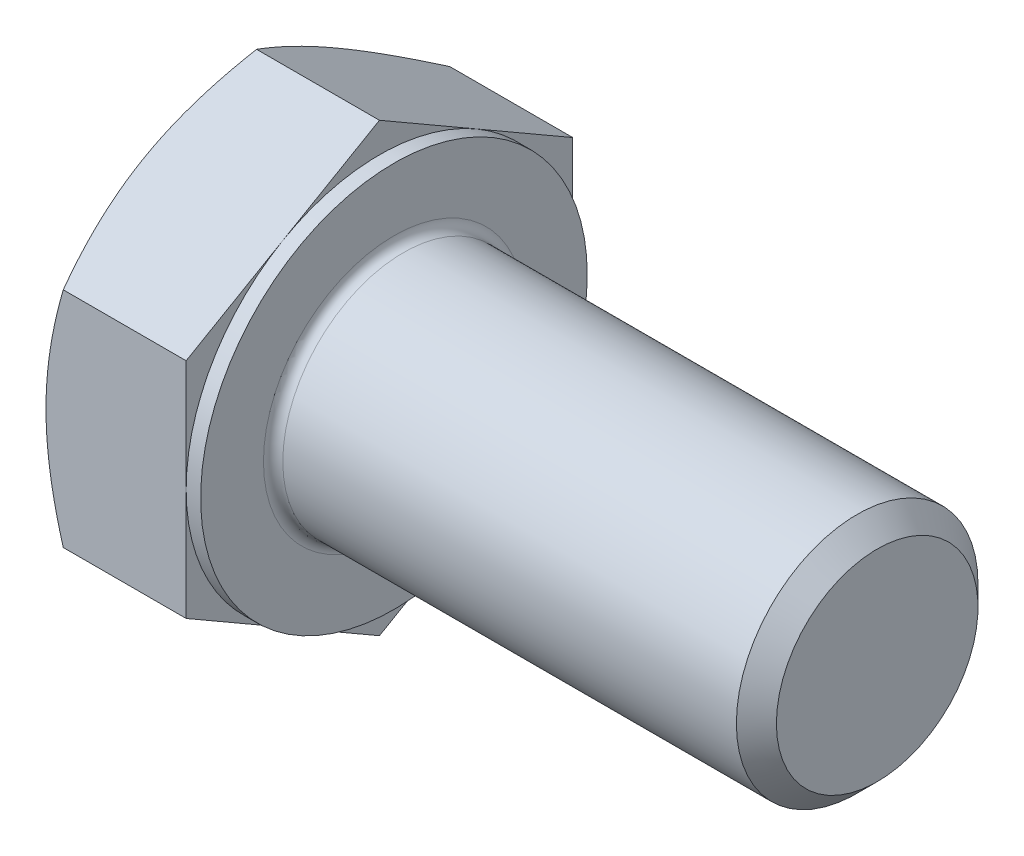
ISO-10303-21;
HEADER;
FILE_DESCRIPTION(('STEP AP214'),'2;1');
FILE_NAME('part.step','',(''),(''),'','','');
FILE_SCHEMA(('AUTOMOTIVE_DESIGN { 1 0 10303 214 1 1 1 1 }'));
ENDSEC;
DATA;
#1=APPLICATION_CONTEXT('core data for automotive mechanical design processes');
#2=APPLICATION_PROTOCOL_DEFINITION('international standard','automotive_design',2000,#1);
#3=PRODUCT_CONTEXT('',#1,'mechanical');
#4=PRODUCT('Part','Part','',(#3));
#5=PRODUCT_RELATED_PRODUCT_CATEGORY('part','',(#4));
#6=PRODUCT_DEFINITION_FORMATION('','',#4);
#7=PRODUCT_DEFINITION_CONTEXT('part definition',#1,'design');
#8=PRODUCT_DEFINITION('design','',#6,#7);
#9=PRODUCT_DEFINITION_SHAPE('','',#8);
#10=(LENGTH_UNIT() NAMED_UNIT(*) SI_UNIT(.MILLI.,.METRE.));
#11=(NAMED_UNIT(*) PLANE_ANGLE_UNIT() SI_UNIT($,.RADIAN.));
#12=(NAMED_UNIT(*) SI_UNIT($,.STERADIAN.) SOLID_ANGLE_UNIT());
#13=UNCERTAINTY_MEASURE_WITH_UNIT(LENGTH_MEASURE(1.E-05),#10,'distance_accuracy_value','');
#14=(GEOMETRIC_REPRESENTATION_CONTEXT(3) GLOBAL_UNCERTAINTY_ASSIGNED_CONTEXT((#13)) GLOBAL_UNIT_ASSIGNED_CONTEXT((#10,
#11,#12)) REPRESENTATION_CONTEXT('',''));
#15=CARTESIAN_POINT('',(0.,0.,0.));
#16=DIRECTION('',(0.,0.,1.));
#17=DIRECTION('',(1.,0.,0.));
#18=AXIS2_PLACEMENT_3D('',#15,#16,#17);
#19=CARTESIAN_POINT('',(6.4,9.23760430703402,0.));
#20=DIRECTION('',(1.,0.,0.));
#21=DIRECTION('',(0.,0.,-1.));
#22=AXIS2_PLACEMENT_3D('',#19,#20,#21);
#23=PLANE('',#22);
#24=CARTESIAN_POINT('',(6.4,0.,0.));
#25=DIRECTION('',(1.,0.,0.));
#26=DIRECTION('',(0.,0.,-1.));
#27=AXIS2_PLACEMENT_3D('',#24,#25,#26);
#28=CIRCLE('',#27,5.4);
#29=CARTESIAN_POINT('',(6.4,0.,-5.4));
#30=VERTEX_POINT('',#29);
#31=EDGE_CURVE('E40',#30,#30,#28,.F.);
#32=ORIENTED_EDGE('',*,*,#31,.T.);
#33=EDGE_LOOP('',(#32));
#34=FACE_BOUND('',#33,.T.);
#35=CARTESIAN_POINT('',(6.4,0.,0.));
#36=DIRECTION('',(1.,0.,0.));
#37=DIRECTION('',(0.,0.,-1.));
#38=AXIS2_PLACEMENT_3D('',#35,#36,#37);
#39=CIRCLE('',#38,8.);
#40=CARTESIAN_POINT('',(6.4,0.,-8.));
#41=VERTEX_POINT('',#40);
#42=EDGE_CURVE('E291',#41,#41,#39,.T.);
#43=ORIENTED_EDGE('',*,*,#42,.T.);
#44=EDGE_LOOP('',(#43));
#45=FACE_BOUND('',#44,.T.);
#46=ADVANCED_FACE('F32',(#34,#45),#23,.T.);
#47=CARTESIAN_POINT('',(0.,0.,0.));
#48=DIRECTION('',(-1.,0.,0.));
#49=DIRECTION('',(0.,0.,1.));
#50=AXIS2_PLACEMENT_3D('',#47,#48,#49);
#51=CYLINDRICAL_SURFACE('',#50,5.);
#52=CARTESIAN_POINT('',(6.8,0.,0.));
#53=DIRECTION('',(1.,0.,0.));
#54=DIRECTION('',(0.,0.,-1.));
#55=AXIS2_PLACEMENT_3D('',#52,#53,#54);
#56=CIRCLE('',#55,5.);
#57=CARTESIAN_POINT('',(6.8,0.,-5.));
#58=VERTEX_POINT('',#57);
#59=EDGE_CURVE('E11',#58,#58,#56,.T.);
#60=ORIENTED_EDGE('',*,*,#59,.T.);
#61=EDGE_LOOP('',(#60));
#62=FACE_BOUND('',#61,.T.);
#63=CARTESIAN_POINT('',(25.5720000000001,0.,0.));
#64=DIRECTION('',(-1.,0.,0.));
#65=DIRECTION('',(0.,0.,1.));
#66=AXIS2_PLACEMENT_3D('',#63,#64,#65);
#67=CIRCLE('',#66,5.);
#68=CARTESIAN_POINT('',(25.5720000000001,0.,5.));
#69=VERTEX_POINT('',#68);
#70=EDGE_CURVE('E270',#69,#69,#67,.T.);
#71=ORIENTED_EDGE('',*,*,#70,.T.);
#72=EDGE_LOOP('',(#71));
#73=FACE_BOUND('',#72,.T.);
#74=ADVANCED_FACE('F244',(#62,#73),#51,.T.);
#75=CARTESIAN_POINT('',(26.4,0.,0.));
#76=DIRECTION('',(-1.,0.,0.));
#77=DIRECTION('',(0.,0.,1.));
#78=AXIS2_PLACEMENT_3D('',#75,#76,#77);
#79=CONICAL_SURFACE('',#78,4.172,0.785398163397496);
#80=ORIENTED_EDGE('',*,*,#70,.F.);
#81=EDGE_LOOP('',(#80));
#82=FACE_BOUND('',#81,.T.);
#83=CARTESIAN_POINT('',(26.4,0.,0.));
#84=DIRECTION('',(-1.,0.,0.));
#85=DIRECTION('',(0.,0.,1.));
#86=AXIS2_PLACEMENT_3D('',#83,#84,#85);
#87=CIRCLE('',#86,4.172);
#88=CARTESIAN_POINT('',(26.4,0.,4.172));
#89=VERTEX_POINT('',#88);
#90=EDGE_CURVE('E268',#89,#89,#87,.T.);
#91=ORIENTED_EDGE('',*,*,#90,.T.);
#92=EDGE_LOOP('',(#91));
#93=FACE_BOUND('',#92,.T.);
#94=ADVANCED_FACE('F249',(#82,#93),#79,.T.);
#95=CARTESIAN_POINT('',(26.4,0.,0.));
#96=DIRECTION('',(-1.,0.,0.));
#97=DIRECTION('',(0.,0.,1.));
#98=AXIS2_PLACEMENT_3D('',#95,#96,#97);
#99=PLANE('',#98);
#100=ORIENTED_EDGE('',*,*,#90,.F.);
#101=EDGE_LOOP('',(#100));
#102=FACE_BOUND('',#101,.T.);
#103=ADVANCED_FACE('F256',(#102),#99,.F.);
#104=CARTESIAN_POINT('',(5.8,8.,0.));
#105=DIRECTION('',(1.,0.,0.));
#106=DIRECTION('',(0.,0.,-1.));
#107=AXIS2_PLACEMENT_3D('',#104,#105,#106);
#108=PLANE('',#107);
#109=DIRECTION('',(0.,0.500000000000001,0.866025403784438));
#110=VECTOR('',#109,1.);
#111=CARTESIAN_POINT('',(5.8,4.618802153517,-8.));
#112=LINE('',#111,#110);
#113=CARTESIAN_POINT('',(5.8,4.618802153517,-8.));
#114=VERTEX_POINT('',#113);
#115=CARTESIAN_POINT('',(5.8,6.92820323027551,-4.00000000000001));
#116=VERTEX_POINT('',#115);
#117=EDGE_CURVE('E164',#114,#116,#112,.T.);
#118=ORIENTED_EDGE('',*,*,#117,.T.);
#119=CARTESIAN_POINT('',(5.8,0.,0.));
#120=DIRECTION('',(-1.,0.,0.));
#121=DIRECTION('',(0.,0.,1.));
#122=AXIS2_PLACEMENT_3D('',#119,#120,#121);
#123=CIRCLE('',#122,8.);
#124=CARTESIAN_POINT('',(5.8,0.,-8.));
#125=VERTEX_POINT('',#124);
#126=EDGE_CURVE('E47',#116,#125,#123,.T.);
#127=ORIENTED_EDGE('',*,*,#126,.T.);
#128=DIRECTION('',(0.,1.,0.));
#129=VECTOR('',#128,1.);
#130=CARTESIAN_POINT('',(5.8,4.618802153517,-8.));
#131=LINE('',#130,#129);
#132=EDGE_CURVE('E294',#125,#114,#131,.T.);
#133=ORIENTED_EDGE('',*,*,#132,.T.);
#134=EDGE_LOOP('',(#118,#127,#133));
#135=FACE_BOUND('',#134,.T.);
#136=ADVANCED_FACE('F259',(#135),#108,.T.);
#137=CARTESIAN_POINT('',(5.8,9.23760430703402,0.));
#138=VERTEX_POINT('',#137);
#139=EDGE_CURVE('E162',#116,#138,#112,.T.);
#140=ORIENTED_EDGE('',*,*,#139,.T.);
#141=DIRECTION('',(0.,-0.500000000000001,0.866025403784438));
#142=VECTOR('',#141,1.);
#143=CARTESIAN_POINT('',(5.8,9.23760430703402,0.));
#144=LINE('',#143,#142);
#145=CARTESIAN_POINT('',(5.8,6.92820323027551,4.00000000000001));
#146=VERTEX_POINT('',#145);
#147=EDGE_CURVE('E161',#138,#146,#144,.T.);
#148=ORIENTED_EDGE('',*,*,#147,.T.);
#149=EDGE_CURVE('E150',#146,#116,#123,.T.);
#150=ORIENTED_EDGE('',*,*,#149,.T.);
#151=EDGE_LOOP('',(#140,#148,#150));
#152=FACE_BOUND('',#151,.T.);
#153=ADVANCED_FACE('F264',(#152),#108,.T.);
#154=CARTESIAN_POINT('',(5.8,4.61880215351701,8.));
#155=VERTEX_POINT('',#154);
#156=EDGE_CURVE('E129',#146,#155,#144,.T.);
#157=ORIENTED_EDGE('',*,*,#156,.T.);
#158=DIRECTION('',(0.,-1.,0.));
#159=VECTOR('',#158,1.);
#160=CARTESIAN_POINT('',(5.8,4.61880215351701,8.));
#161=LINE('',#160,#159);
#162=CARTESIAN_POINT('',(5.8,0.,8.));
#163=VERTEX_POINT('',#162);
#164=EDGE_CURVE('E123',#155,#163,#161,.T.);
#165=ORIENTED_EDGE('',*,*,#164,.T.);
#166=EDGE_CURVE('E127',#163,#146,#123,.T.);
#167=ORIENTED_EDGE('',*,*,#166,.T.);
#168=EDGE_LOOP('',(#157,#165,#167));
#169=FACE_BOUND('',#168,.T.);
#170=ADVANCED_FACE('F125',(#169),#108,.T.);
#171=CARTESIAN_POINT('',(5.8,-4.61880215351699,8.));
#172=VERTEX_POINT('',#171);
#173=EDGE_CURVE('E133',#163,#172,#161,.T.);
#174=ORIENTED_EDGE('',*,*,#173,.T.);
#175=DIRECTION('',(0.,-0.500000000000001,-0.866025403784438));
#176=VECTOR('',#175,1.);
#177=CARTESIAN_POINT('',(5.8,-9.23760430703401,0.));
#178=LINE('',#177,#176);
#179=CARTESIAN_POINT('',(5.8,-6.92820323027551,4.00000000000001));
#180=VERTEX_POINT('',#179);
#181=EDGE_CURVE('E140',#172,#180,#178,.T.);
#182=ORIENTED_EDGE('',*,*,#181,.T.);
#183=EDGE_CURVE('E137',#180,#163,#123,.T.);
#184=ORIENTED_EDGE('',*,*,#183,.T.);
#185=EDGE_LOOP('',(#174,#182,#184));
#186=FACE_BOUND('',#185,.T.);
#187=ADVANCED_FACE('F138',(#186),#108,.T.);
#188=CARTESIAN_POINT('',(5.8,-9.23760430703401,0.));
#189=VERTEX_POINT('',#188);
#190=EDGE_CURVE('E156',#180,#189,#178,.T.);
#191=ORIENTED_EDGE('',*,*,#190,.T.);
#192=DIRECTION('',(0.,0.5,-0.866025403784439));
#193=VECTOR('',#192,1.);
#194=CARTESIAN_POINT('',(5.8,-4.61880215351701,-8.));
#195=LINE('',#194,#193);
#196=CARTESIAN_POINT('',(5.8,-6.92820323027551,-4.));
#197=VERTEX_POINT('',#196);
#198=EDGE_CURVE('E332',#189,#197,#195,.T.);
#199=ORIENTED_EDGE('',*,*,#198,.T.);
#200=EDGE_CURVE('E144',#197,#180,#123,.T.);
#201=ORIENTED_EDGE('',*,*,#200,.T.);
#202=EDGE_LOOP('',(#191,#199,#201));
#203=FACE_BOUND('',#202,.T.);
#204=ADVANCED_FACE('F333',(#203),#108,.T.);
#205=CARTESIAN_POINT('',(5.8,-4.61880215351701,-8.));
#206=VERTEX_POINT('',#205);
#207=EDGE_CURVE('E151',#197,#206,#195,.T.);
#208=ORIENTED_EDGE('',*,*,#207,.T.);
#209=EDGE_CURVE('E295',#206,#125,#131,.T.);
#210=ORIENTED_EDGE('',*,*,#209,.T.);
#211=EDGE_CURVE('E302',#125,#197,#123,.T.);
#212=ORIENTED_EDGE('',*,*,#211,.T.);
#213=EDGE_LOOP('',(#208,#210,#212));
#214=FACE_BOUND('',#213,.T.);
#215=ADVANCED_FACE('F265',(#214),#108,.T.);
#216=CARTESIAN_POINT('',(0.,0.,0.));
#217=DIRECTION('',(-1.,0.,0.));
#218=DIRECTION('',(0.,0.,1.));
#219=AXIS2_PLACEMENT_3D('',#216,#217,#218);
#220=CYLINDRICAL_SURFACE('',#219,8.);
#221=ORIENTED_EDGE('',*,*,#126,.F.);
#222=ORIENTED_EDGE('',*,*,#149,.F.);
#223=ORIENTED_EDGE('',*,*,#166,.F.);
#224=ORIENTED_EDGE('',*,*,#183,.F.);
#225=ORIENTED_EDGE('',*,*,#200,.F.);
#226=ORIENTED_EDGE('',*,*,#211,.F.);
#227=EDGE_LOOP('',(#221,#222,#223,#224,#225,#226));
#228=FACE_BOUND('',#227,.T.);
#229=ORIENTED_EDGE('',*,*,#42,.F.);
#230=EDGE_LOOP('',(#229));
#231=FACE_BOUND('',#230,.T.);
#232=ADVANCED_FACE('F147',(#228,#231),#220,.T.);
#233=CARTESIAN_POINT('',(0.,9.23760430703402,0.));
#234=DIRECTION('',(1.,0.,0.));
#235=DIRECTION('',(0.,0.,-1.));
#236=AXIS2_PLACEMENT_3D('',#233,#234,#235);
#237=PLANE('',#236);
#238=CARTESIAN_POINT('',(0.,0.,0.));
#239=DIRECTION('',(1.,0.,0.));
#240=DIRECTION('',(0.,0.,-1.));
#241=AXIS2_PLACEMENT_3D('',#238,#239,#240);
#242=CIRCLE('',#241,8.);
#243=CARTESIAN_POINT('',(0.,0.,-8.));
#244=VERTEX_POINT('',#243);
#245=CARTESIAN_POINT('',(0.,6.92820323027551,-4.00000000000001));
#246=VERTEX_POINT('',#245);
#247=EDGE_CURVE('E290',#244,#246,#242,.T.);
#248=ORIENTED_EDGE('',*,*,#247,.F.);
#249=CARTESIAN_POINT('',(0.,-6.92820323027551,-4.));
#250=VERTEX_POINT('',#249);
#251=EDGE_CURVE('E286',#250,#244,#242,.T.);
#252=ORIENTED_EDGE('',*,*,#251,.F.);
#253=CARTESIAN_POINT('',(0.,-6.9282032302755,4.00000000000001));
#254=VERTEX_POINT('',#253);
#255=EDGE_CURVE('E289',#254,#250,#242,.T.);
#256=ORIENTED_EDGE('',*,*,#255,.F.);
#257=CARTESIAN_POINT('',(0.,0.,8.));
#258=VERTEX_POINT('',#257);
#259=EDGE_CURVE('E325',#258,#254,#242,.T.);
#260=ORIENTED_EDGE('',*,*,#259,.F.);
#261=CARTESIAN_POINT('',(0.,0.,0.));
#262=DIRECTION('',(-1.,0.,0.));
#263=DIRECTION('',(0.,0.,1.));
#264=AXIS2_PLACEMENT_3D('',#261,#262,#263);
#265=CIRCLE('',#264,8.);
#266=CARTESIAN_POINT('',(0.,6.92820323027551,4.00000000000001));
#267=VERTEX_POINT('',#266);
#268=EDGE_CURVE('E165',#258,#267,#265,.T.);
#269=ORIENTED_EDGE('',*,*,#268,.T.);
#270=EDGE_CURVE('E348',#246,#267,#242,.T.);
#271=ORIENTED_EDGE('',*,*,#270,.F.);
#272=EDGE_LOOP('',(#248,#252,#256,#260,#269,#271));
#273=FACE_BOUND('',#272,.T.);
#274=ADVANCED_FACE('F194',(#273),#237,.F.);
#275=CARTESIAN_POINT('',(0.,0.,0.));
#276=DIRECTION('',(1.,0.,0.));
#277=DIRECTION('',(0.,0.,-1.));
#278=AXIS2_PLACEMENT_3D('',#275,#276,#277);
#279=CONICAL_SURFACE('',#278,8.,1.0471975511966);
#280=CARTESIAN_POINT('',(0.714597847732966,4.61868668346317,8.0002));
#281=CARTESIAN_POINT('',(0.655990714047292,4.72021302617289,7.8243512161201));
#282=CARTESIAN_POINT('',(0.600043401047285,4.82211789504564,7.64784680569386));
#283=CARTESIAN_POINT('',(0.494201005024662,5.02675523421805,7.29340453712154));
#284=CARTESIAN_POINT('',(0.444308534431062,5.12948804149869,7.11546609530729));
#285=CARTESIAN_POINT('',(0.304692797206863,5.43933133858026,6.57880176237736));
#286=CARTESIAN_POINT('',(0.225281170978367,5.64766491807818,6.21795741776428));
#287=CARTESIAN_POINT('',(0.132161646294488,5.95943209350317,5.67796082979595));
#288=CARTESIAN_POINT('',(0.105634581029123,6.06193429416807,5.50042181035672));
#289=CARTESIAN_POINT('',(0.0611531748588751,6.26740224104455,5.1445408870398));
#290=CARTESIAN_POINT('',(0.04319807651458,6.37036794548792,4.96619905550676));
#291=CARTESIAN_POINT('',(0.0163156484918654,6.57647664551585,4.60920831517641));
#292=CARTESIAN_POINT('',(0.00737807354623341,6.67961930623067,4.4305599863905));
#293=CARTESIAN_POINT('',(-0.00127769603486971,6.88599991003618,4.07309829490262));
#294=CARTESIAN_POINT('',(-0.000996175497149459,6.98923785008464,3.89428493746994));
#295=CARTESIAN_POINT('',(0.00814502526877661,7.18224506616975,3.5599866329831));
#296=CARTESIAN_POINT('',(0.0158896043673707,7.27202796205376,3.40447809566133));
#297=CARTESIAN_POINT('',(0.0382011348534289,7.45138347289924,3.09382523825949));
#298=CARTESIAN_POINT('',(0.0527685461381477,7.54095607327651,2.93868094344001));
#299=CARTESIAN_POINT('',(0.106360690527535,7.80932710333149,2.47384868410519));
#300=CARTESIAN_POINT('',(0.155268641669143,7.98765049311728,2.16498351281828));
#301=CARTESIAN_POINT('',(0.277539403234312,8.34618890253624,1.5439767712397));
#302=CARTESIAN_POINT('',(0.351420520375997,8.52635816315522,1.23191445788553));
#303=CARTESIAN_POINT('',(0.519100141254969,8.88400987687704,0.612443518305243));
#304=CARTESIAN_POINT('',(0.612859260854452,9.06149691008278,0.30502695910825));
#305=CARTESIAN_POINT('',(0.714597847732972,9.23771977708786,-0.00019999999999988));
#306=B_SPLINE_CURVE_WITH_KNOTS('',3,(#280,#281,#282,#283,#284,#285,#286,#287,#288,#289,#290,
#291,#292,#293,#294,#295,#296,#297,#298,#299,#300,#301,#302,#303,#304,#305),.UNSPECIFIED.,.F.,
.F.,(4,2,2,2,2,2,2,2,2,2,2,2,4),(0.,0.633973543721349,1.26821965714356,2.53934712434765,
3.15934343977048,3.77928496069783,4.39852133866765,5.01773858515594,5.55680239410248,
6.09590254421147,7.17487077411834,8.27776850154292,9.37850115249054),.UNSPECIFIED.);
#307=CARTESIAN_POINT('',(0.714531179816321,9.23760430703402,0.));
#308=VERTEX_POINT('',#307);
#309=EDGE_CURVE('E213',#267,#308,#306,.T.);
#310=ORIENTED_EDGE('',*,*,#309,.T.);
#311=CARTESIAN_POINT('',(0.714597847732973,9.23771977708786,0.0002));
#312=CARTESIAN_POINT('',(0.655990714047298,9.13619343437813,-0.175648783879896));
#313=CARTESIAN_POINT('',(0.60004340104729,9.03428856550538,-0.352153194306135));
#314=CARTESIAN_POINT('',(0.494201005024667,8.82965122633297,-0.706595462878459));
#315=CARTESIAN_POINT('',(0.444308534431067,8.72691841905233,-0.884533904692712));
#316=CARTESIAN_POINT('',(0.304692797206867,8.41707512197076,-1.42119823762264));
#317=CARTESIAN_POINT('',(0.22528117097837,8.20874154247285,-1.78204258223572));
#318=CARTESIAN_POINT('',(0.13216164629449,7.89697436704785,-2.32203917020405));
#319=CARTESIAN_POINT('',(0.105634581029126,7.79447216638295,-2.49957818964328));
#320=CARTESIAN_POINT('',(0.0611531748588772,7.58900421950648,-2.8554591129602));
#321=CARTESIAN_POINT('',(0.0431980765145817,7.4860385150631,-3.03380094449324));
#322=CARTESIAN_POINT('',(0.0163156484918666,7.27992981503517,-3.39079168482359));
#323=CARTESIAN_POINT('',(0.00737807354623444,7.17678715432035,-3.5694400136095));
#324=CARTESIAN_POINT('',(-0.00127769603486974,6.97040655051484,-3.92690170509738));
#325=CARTESIAN_POINT('',(-0.00099617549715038,6.86716861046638,-4.10571506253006));
#326=CARTESIAN_POINT('',(0.00814502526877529,6.67416139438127,-4.4400133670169));
#327=CARTESIAN_POINT('',(0.0158896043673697,6.58437849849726,-4.59552190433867));
#328=CARTESIAN_POINT('',(0.0382011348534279,6.40502298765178,-4.90617476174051));
#329=CARTESIAN_POINT('',(0.0527685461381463,6.31545038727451,-5.06131905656));
#330=CARTESIAN_POINT('',(0.106360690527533,6.04707935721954,-5.52615131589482));
#331=CARTESIAN_POINT('',(0.155268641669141,5.86875596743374,-5.83501648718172));
#332=CARTESIAN_POINT('',(0.277539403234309,5.51021755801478,-6.4560232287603));
#333=CARTESIAN_POINT('',(0.351420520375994,5.3300482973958,-6.76808554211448));
#334=CARTESIAN_POINT('',(0.519100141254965,4.97239658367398,-7.38755648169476));
#335=CARTESIAN_POINT('',(0.612859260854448,4.79490955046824,-7.69497304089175));
#336=CARTESIAN_POINT('',(0.714597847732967,4.61868668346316,-8.0002));
#337=B_SPLINE_CURVE_WITH_KNOTS('',3,(#311,#312,#313,#314,#315,#316,#317,#318,#319,#320,#321,
#322,#323,#324,#325,#326,#327,#328,#329,#330,#331,#332,#333,#334,#335,#336),.UNSPECIFIED.,.F.,
.F.,(4,2,2,2,2,2,2,2,2,2,2,2,4),(0.,0.633973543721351,1.26821965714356,2.53934712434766,
3.15934343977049,3.77928496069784,4.39852133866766,5.01773858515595,5.55680239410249,
6.09590254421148,7.17487077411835,8.27776850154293,9.37850115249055),.UNSPECIFIED.);
#338=EDGE_CURVE('E55',#308,#246,#337,.T.);
#339=ORIENTED_EDGE('',*,*,#338,.T.);
#340=ORIENTED_EDGE('',*,*,#270,.T.);
#341=EDGE_LOOP('',(#310,#339,#340));
#342=FACE_BOUND('',#341,.T.);
#343=ADVANCED_FACE('F349',(#342),#279,.T.);
#344=CARTESIAN_POINT('',(4.02490591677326,-12.6546855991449,8.));
#345=CARTESIAN_POINT('',(3.85338488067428,-12.3031246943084,8.));
#346=CARTESIAN_POINT('',(3.68343820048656,-11.9507829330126,8.));
#347=CARTESIAN_POINT('',(3.3475742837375,-11.2441233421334,8.));
#348=CARTESIAN_POINT('',(3.18165763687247,-10.8898052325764,8.));
#349=CARTESIAN_POINT('',(2.85395194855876,-10.1770689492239,8.));
#350=CARTESIAN_POINT('',(2.69218825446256,-9.81863908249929,8.));
#351=CARTESIAN_POINT('',(2.37495727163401,-9.09901413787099,8.));
#352=CARTESIAN_POINT('',(2.21948970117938,-8.73781918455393,8.));
#353=CARTESIAN_POINT('',(1.91124909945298,-7.9995005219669,8.));
#354=CARTESIAN_POINT('',(1.75875676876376,-7.6222589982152,8.));
#355=CARTESIAN_POINT('',(1.46472411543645,-6.86345577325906,8.));
#356=CARTESIAN_POINT('',(1.323184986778,-6.48189360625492,8.));
#357=CARTESIAN_POINT('',(1.05459432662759,-5.71447512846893,8.));
#358=CARTESIAN_POINT('',(0.927515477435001,-5.32862847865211,8.));
#359=CARTESIAN_POINT('',(0.69175721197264,-4.55141880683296,8.));
#360=CARTESIAN_POINT('',(0.583072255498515,-4.16005748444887,8.));
#361=CARTESIAN_POINT('',(0.389750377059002,-3.37376378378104,8.));
#362=CARTESIAN_POINT('',(0.304973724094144,-2.97886668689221,8.));
#363=CARTESIAN_POINT('',(0.199275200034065,-2.38273452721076,8.));
#364=CARTESIAN_POINT('',(0.167618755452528,-2.18337977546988,8.));
#365=CARTESIAN_POINT('',(0.112075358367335,-1.78359737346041,8.));
#366=CARTESIAN_POINT('',(0.0881876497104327,-1.58316982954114,8.));
#367=CARTESIAN_POINT('',(0.0489706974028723,-1.184235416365,8.));
#368=CARTESIAN_POINT('',(0.0335291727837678,-0.985739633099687,8.));
#369=CARTESIAN_POINT('',(0.0110629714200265,-0.58827208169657,8.));
#370=CARTESIAN_POINT('',(0.00403814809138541,-0.38930032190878,8.));
#371=CARTESIAN_POINT('',(-0.00142584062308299,0.00876221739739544,8.));
#372=CARTESIAN_POINT('',(0.000134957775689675,0.207852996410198,8.));
#373=CARTESIAN_POINT('',(0.0118014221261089,0.605786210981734,8.));
#374=CARTESIAN_POINT('',(0.0219074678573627,0.804628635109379,8.));
#375=CARTESIAN_POINT('',(0.0557165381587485,1.27520492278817,8.));
#376=CARTESIAN_POINT('',(0.0830672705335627,1.5466829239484,8.));
#377=CARTESIAN_POINT('',(0.152259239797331,2.08777093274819,8.));
#378=CARTESIAN_POINT('',(0.194102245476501,2.35738070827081,8.));
#379=CARTESIAN_POINT('',(0.33916319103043,3.1630177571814,7.99999999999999));
#380=CARTESIAN_POINT('',(0.461891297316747,3.69558689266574,8.));
#381=CARTESIAN_POINT('',(0.676586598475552,4.49226054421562,8.));
#382=CARTESIAN_POINT('',(0.754301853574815,4.76044513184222,8.));
#383=CARTESIAN_POINT('',(0.918275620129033,5.29421545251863,8.));
#384=CARTESIAN_POINT('',(1.00453419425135,5.55980116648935,8.));
#385=CARTESIAN_POINT('',(1.1841720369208,6.08844838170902,8.));
#386=CARTESIAN_POINT('',(1.27754932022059,6.35151056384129,8.));
#387=CARTESIAN_POINT('',(1.47027925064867,6.8754242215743,8.));
#388=CARTESIAN_POINT('',(1.56963178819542,7.1362757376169,7.99999999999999));
#389=CARTESIAN_POINT('',(1.83061788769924,7.80218876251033,7.99999999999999));
#390=CARTESIAN_POINT('',(1.99585031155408,8.20583801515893,7.99999999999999));
#391=CARTESIAN_POINT('',(2.33560644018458,9.00922091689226,7.99999999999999));
#392=CARTESIAN_POINT('',(2.51013099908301,9.40895420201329,7.99999999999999));
#393=CARTESIAN_POINT('',(2.86641485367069,10.2053302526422,7.99999999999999));
#394=CARTESIAN_POINT('',(3.04817649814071,10.6019719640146,7.99999999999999));
#395=CARTESIAN_POINT('',(3.41731475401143,11.3926098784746,7.99999999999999));
#396=CARTESIAN_POINT('',(3.60469118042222,11.7866061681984,7.99999999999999));
#397=CARTESIAN_POINT('',(3.98417977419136,12.5730081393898,7.99999999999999));
#398=CARTESIAN_POINT('',(4.17629838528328,12.9654107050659,7.99999999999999));
#399=CARTESIAN_POINT('',(4.56413461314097,13.7484335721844,7.99999999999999));
#400=CARTESIAN_POINT('',(4.75985225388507,14.1390538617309,7.99999999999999));
#401=CARTESIAN_POINT('',(5.15417791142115,14.9187387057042,7.99999999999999));
#402=CARTESIAN_POINT('',(5.35278537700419,15.3078035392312,7.99999999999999));
#403=CARTESIAN_POINT('',(5.75241278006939,16.0846929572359,7.99999999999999));
#404=CARTESIAN_POINT('',(5.95343272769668,16.4725175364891,7.99999999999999));
#405=CARTESIAN_POINT('',(6.52023158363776,17.559169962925,7.99999999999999));
#406=CARTESIAN_POINT('',(6.88826669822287,18.2568208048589,7.99999999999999));
#407=CARTESIAN_POINT('',(7.62911646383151,19.6496204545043,7.99999999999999));
#408=CARTESIAN_POINT('',(8.00193136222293,20.3447691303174,7.99999999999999));
#409=CARTESIAN_POINT('',(8.74998840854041,21.7309493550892,7.99999999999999));
#410=CARTESIAN_POINT('',(9.12521930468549,22.4219869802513,7.99999999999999));
#411=CARTESIAN_POINT('',(9.69012626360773,23.4573861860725,7.99999999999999));
#412=CARTESIAN_POINT('',(9.87876537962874,23.8023143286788,7.99999999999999));
#413=CARTESIAN_POINT('',(10.2566598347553,24.491832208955,7.99999999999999));
#414=CARTESIAN_POINT('',(10.4459151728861,24.8364219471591,7.99999999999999));
#415=CARTESIAN_POINT('',(10.6354414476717,25.1808626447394,7.99999999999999));
#416=B_SPLINE_CURVE_WITH_KNOTS('',3,(#344,#345,#346,#347,#348,#349,#350,#351,#352,#353,#354,
#355,#356,#357,#358,#359,#360,#361,#362,#363,#364,#365,#366,#367,#368,#369,#370,#371,#372,#373,
#374,#375,#376,#377,#378,#379,#380,#381,#382,#383,#384,#385,#386,#387,#388,#389,#390,#391,#392,
#393,#394,#395,#396,#397,#398,#399,#400,#401,#402,#403,#404,#405,#406,#407,#408,#409,#410,#411,
#412,#413,#414,#415),.UNSPECIFIED.,.F.,.F.,(4,2,2,2,2,2,2,2,2,2,2,2,2,2,2,2,2,2,2,2,2,2,2,2,2,2,
2,2,2,2,2,2,2,2,2,4),(0.,1.17352534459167,2.34722138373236,3.52689945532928,4.70652468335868,
5.92708318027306,7.14777454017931,8.36612013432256,9.58409810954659,10.7948027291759,
11.40023293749,12.0056041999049,12.6027191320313,13.1998236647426,13.7969256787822,
14.3940542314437,15.2121538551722,16.0303533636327,17.6675489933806,18.5051258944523,
19.3427089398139,20.180059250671,21.0173942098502,22.3257038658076,23.6341339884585,
24.9429922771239,26.2518074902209,27.5625113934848,28.8732240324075,30.1836898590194,
31.4941611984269,33.8604586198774,36.2268790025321,38.5858914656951,39.7653151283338,
40.9447369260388),.UNSPECIFIED.);
#417=CARTESIAN_POINT('',(0.714531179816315,4.61880215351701,8.));
#418=VERTEX_POINT('',#417);
#419=EDGE_CURVE('E225',#258,#418,#416,.T.);
#420=ORIENTED_EDGE('',*,*,#419,.T.);
#421=EDGE_CURVE('E224',#418,#267,#306,.T.);
#422=ORIENTED_EDGE('',*,*,#421,.T.);
#423=ORIENTED_EDGE('',*,*,#268,.F.);
#424=EDGE_LOOP('',(#420,#422,#423));
#425=FACE_BOUND('',#424,.T.);
#426=ADVANCED_FACE('F319',(#425),#279,.T.);
#427=CARTESIAN_POINT('',(0.714531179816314,-4.61880215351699,8.));
#428=VERTEX_POINT('',#427);
#429=EDGE_CURVE('E271',#428,#258,#416,.T.);
#430=ORIENTED_EDGE('',*,*,#429,.T.);
#431=ORIENTED_EDGE('',*,*,#259,.T.);
#432=CARTESIAN_POINT('',(0.714597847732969,-9.23771977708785,-0.000199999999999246));
#433=CARTESIAN_POINT('',(0.655990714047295,-9.13619343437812,0.175648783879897));
#434=CARTESIAN_POINT('',(0.600043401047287,-9.03428856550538,0.352153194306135));
#435=CARTESIAN_POINT('',(0.494201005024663,-8.82965122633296,0.706595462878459));
#436=CARTESIAN_POINT('',(0.444308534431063,-8.72691841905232,0.884533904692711));
#437=CARTESIAN_POINT('',(0.304692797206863,-8.41707512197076,1.42119823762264));
#438=CARTESIAN_POINT('',(0.225281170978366,-8.20874154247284,1.78204258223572));
#439=CARTESIAN_POINT('',(0.132161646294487,-7.89697436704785,2.32203917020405));
#440=CARTESIAN_POINT('',(0.105634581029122,-7.79447216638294,2.49957818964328));
#441=CARTESIAN_POINT('',(0.0611531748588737,-7.58900421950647,2.8554591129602));
#442=CARTESIAN_POINT('',(0.0431980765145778,-7.4860385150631,3.03380094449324));
#443=CARTESIAN_POINT('',(0.0163156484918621,-7.27992981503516,3.39079168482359));
#444=CARTESIAN_POINT('',(0.00737807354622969,-7.17678715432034,3.5694400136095));
#445=CARTESIAN_POINT('',(-0.00127769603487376,-6.97040655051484,3.92690170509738));
#446=CARTESIAN_POINT('',(-0.000996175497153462,-6.86716861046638,4.10571506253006));
#447=CARTESIAN_POINT('',(0.00814502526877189,-6.67416139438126,4.4400133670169));
#448=CARTESIAN_POINT('',(0.0158896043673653,-6.58437849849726,4.59552190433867));
#449=CARTESIAN_POINT('',(0.0382011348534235,-6.40502298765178,4.90617476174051));
#450=CARTESIAN_POINT('',(0.052768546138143,-6.31545038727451,5.06131905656));
#451=CARTESIAN_POINT('',(0.106360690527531,-6.04707935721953,5.52615131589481));
#452=CARTESIAN_POINT('',(0.155268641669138,-5.86875596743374,5.83501648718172));
#453=CARTESIAN_POINT('',(0.277539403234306,-5.51021755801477,6.4560232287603));
#454=CARTESIAN_POINT('',(0.351420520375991,-5.3300482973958,6.76808554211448));
#455=CARTESIAN_POINT('',(0.519100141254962,-4.97239658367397,7.38755648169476));
#456=CARTESIAN_POINT('',(0.612859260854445,-4.79490955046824,7.69497304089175));
#457=CARTESIAN_POINT('',(0.714597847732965,-4.61868668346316,8.0002));
#458=B_SPLINE_CURVE_WITH_KNOTS('',3,(#432,#433,#434,#435,#436,#437,#438,#439,#440,#441,#442,
#443,#444,#445,#446,#447,#448,#449,#450,#451,#452,#453,#454,#455,#456,#457),.UNSPECIFIED.,.F.,
.F.,(4,2,2,2,2,2,2,2,2,2,2,2,4),(0.,0.63397354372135,1.26821965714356,2.53934712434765,
3.15934343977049,3.77928496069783,4.39852133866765,5.01773858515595,5.55680239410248,
6.09590254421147,7.17487077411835,8.27776850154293,9.37850115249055),.UNSPECIFIED.);
#459=EDGE_CURVE('E215',#254,#428,#458,.T.);
#460=ORIENTED_EDGE('',*,*,#459,.T.);
#461=EDGE_LOOP('',(#430,#431,#460));
#462=FACE_BOUND('',#461,.T.);
#463=ADVANCED_FACE('F183',(#462),#279,.T.);
#464=CARTESIAN_POINT('',(0.714531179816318,-9.23760430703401,0.));
#465=VERTEX_POINT('',#464);
#466=EDGE_CURVE('E208',#465,#254,#458,.T.);
#467=ORIENTED_EDGE('',*,*,#466,.T.);
#468=ORIENTED_EDGE('',*,*,#255,.T.);
#469=CARTESIAN_POINT('',(0.71459784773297,-4.61868668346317,-8.0002));
#470=CARTESIAN_POINT('',(0.655990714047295,-4.7202130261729,-7.82435121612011));
#471=CARTESIAN_POINT('',(0.600043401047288,-4.82211789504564,-7.64784680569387));
#472=CARTESIAN_POINT('',(0.494201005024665,-5.02675523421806,-7.29340453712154));
#473=CARTESIAN_POINT('',(0.444308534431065,-5.1294880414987,-7.11546609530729));
#474=CARTESIAN_POINT('',(0.304692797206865,-5.43933133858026,-6.57880176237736));
#475=CARTESIAN_POINT('',(0.225281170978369,-5.64766491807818,-6.21795741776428));
#476=CARTESIAN_POINT('',(0.132161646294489,-5.95943209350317,-5.67796082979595));
#477=CARTESIAN_POINT('',(0.105634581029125,-6.06193429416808,-5.50042181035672));
#478=CARTESIAN_POINT('',(0.0611531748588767,-6.26740224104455,-5.1445408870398));
#479=CARTESIAN_POINT('',(0.0431980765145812,-6.37036794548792,-4.96619905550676));
#480=CARTESIAN_POINT('',(0.0163156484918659,-6.57647664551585,-4.60920831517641));
#481=CARTESIAN_POINT('',(0.00737807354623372,-6.67961930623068,-4.4305599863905));
#482=CARTESIAN_POINT('',(-0.00127769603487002,-6.88599991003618,-4.07309829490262));
#483=CARTESIAN_POINT('',(-0.000996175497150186,-6.98923785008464,-3.89428493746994));
#484=CARTESIAN_POINT('',(0.00814502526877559,-7.18224506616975,-3.5599866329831));
#485=CARTESIAN_POINT('',(0.0158896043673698,-7.27202796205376,-3.40447809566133));
#486=CARTESIAN_POINT('',(0.0382011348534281,-7.45138347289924,-3.09382523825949));
#487=CARTESIAN_POINT('',(0.052768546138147,-7.54095607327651,-2.93868094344));
#488=CARTESIAN_POINT('',(0.106360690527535,-7.80932710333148,-2.47384868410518));
#489=CARTESIAN_POINT('',(0.155268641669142,-7.98765049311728,-2.16498351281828));
#490=CARTESIAN_POINT('',(0.27753940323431,-8.34618890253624,-1.5439767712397));
#491=CARTESIAN_POINT('',(0.351420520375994,-8.52635816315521,-1.23191445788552));
#492=CARTESIAN_POINT('',(0.519100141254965,-8.88400987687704,-0.61244351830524));
#493=CARTESIAN_POINT('',(0.612859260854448,-9.06149691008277,-0.305026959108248));
#494=CARTESIAN_POINT('',(0.714597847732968,-9.23771977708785,0.000200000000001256));
#495=B_SPLINE_CURVE_WITH_KNOTS('',3,(#469,#470,#471,#472,#473,#474,#475,#476,#477,#478,#479,
#480,#481,#482,#483,#484,#485,#486,#487,#488,#489,#490,#491,#492,#493,#494),.UNSPECIFIED.,.F.,
.F.,(4,2,2,2,2,2,2,2,2,2,2,2,4),(0.,0.633973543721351,1.26821965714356,2.53934712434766,
3.15934343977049,3.77928496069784,4.39852133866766,5.01773858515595,5.55680239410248,
6.09590254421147,7.17487077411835,8.27776850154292,9.37850115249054),.UNSPECIFIED.);
#496=EDGE_CURVE('E214',#250,#465,#495,.T.);
#497=ORIENTED_EDGE('',*,*,#496,.T.);
#498=EDGE_LOOP('',(#467,#468,#497));
#499=FACE_BOUND('',#498,.T.);
#500=ADVANCED_FACE('F347',(#499),#279,.T.);
#501=CARTESIAN_POINT('',(0.714531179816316,4.618802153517,-8.));
#502=VERTEX_POINT('',#501);
#503=EDGE_CURVE('E216',#246,#502,#337,.T.);
#504=ORIENTED_EDGE('',*,*,#503,.T.);
#505=CARTESIAN_POINT('',(4.02490591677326,-12.6546855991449,-8.));
#506=CARTESIAN_POINT('',(3.85338488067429,-12.3031246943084,-8.));
#507=CARTESIAN_POINT('',(3.68343820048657,-11.9507829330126,-8.));
#508=CARTESIAN_POINT('',(3.34757428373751,-11.2441233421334,-8.));
#509=CARTESIAN_POINT('',(3.18165763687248,-10.8898052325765,-8.));
#510=CARTESIAN_POINT('',(2.85395194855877,-10.177068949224,-8.));
#511=CARTESIAN_POINT('',(2.69218825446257,-9.8186390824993,-8.));
#512=CARTESIAN_POINT('',(2.37495727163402,-9.099014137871,-8.));
#513=CARTESIAN_POINT('',(2.21948970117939,-8.73781918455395,-8.));
#514=CARTESIAN_POINT('',(1.91124909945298,-7.99950052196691,-8.));
#515=CARTESIAN_POINT('',(1.75875676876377,-7.62225899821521,-8.));
#516=CARTESIAN_POINT('',(1.46472411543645,-6.86345577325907,-8.));
#517=CARTESIAN_POINT('',(1.323184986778,-6.48189360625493,-8.));
#518=CARTESIAN_POINT('',(1.05459432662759,-5.71447512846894,-8.));
#519=CARTESIAN_POINT('',(0.927515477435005,-5.32862847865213,-8.));
#520=CARTESIAN_POINT('',(0.691757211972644,-4.55141880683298,-8.));
#521=CARTESIAN_POINT('',(0.58307225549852,-4.16005748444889,-8.));
#522=CARTESIAN_POINT('',(0.389750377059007,-3.37376378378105,-8.));
#523=CARTESIAN_POINT('',(0.304973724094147,-2.97886668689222,-8.));
#524=CARTESIAN_POINT('',(0.199275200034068,-2.38273452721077,-8.));
#525=CARTESIAN_POINT('',(0.167618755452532,-2.18337977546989,-8.));
#526=CARTESIAN_POINT('',(0.112075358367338,-1.78359737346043,-8.));
#527=CARTESIAN_POINT('',(0.0881876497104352,-1.58316982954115,-8.));
#528=CARTESIAN_POINT('',(0.0489706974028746,-1.18423541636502,-8.));
#529=CARTESIAN_POINT('',(0.0335291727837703,-0.9857396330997,-8.));
#530=CARTESIAN_POINT('',(0.0110629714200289,-0.588272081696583,-8.));
#531=CARTESIAN_POINT('',(0.00403814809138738,-0.389300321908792,-8.));
#532=CARTESIAN_POINT('',(-0.001425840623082,0.00876221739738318,-8.));
#533=CARTESIAN_POINT('',(0.000134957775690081,0.207852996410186,-8.));
#534=CARTESIAN_POINT('',(0.0118014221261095,0.605786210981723,-8.));
#535=CARTESIAN_POINT('',(0.0219074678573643,0.804628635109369,-8.));
#536=CARTESIAN_POINT('',(0.0557165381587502,1.27520492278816,-8.));
#537=CARTESIAN_POINT('',(0.0830672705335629,1.54668292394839,-8.));
#538=CARTESIAN_POINT('',(0.15225923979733,2.08777093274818,-8.));
#539=CARTESIAN_POINT('',(0.194102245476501,2.3573807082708,-8.));
#540=CARTESIAN_POINT('',(0.339163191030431,3.16301775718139,-8.));
#541=CARTESIAN_POINT('',(0.461891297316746,3.69558689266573,-8.));
#542=CARTESIAN_POINT('',(0.676586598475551,4.49226054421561,-8.));
#543=CARTESIAN_POINT('',(0.754301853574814,4.76044513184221,-8.));
#544=CARTESIAN_POINT('',(0.918275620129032,5.29421545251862,-8.));
#545=CARTESIAN_POINT('',(1.00453419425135,5.55980116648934,-8.));
#546=CARTESIAN_POINT('',(1.1841720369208,6.088448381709,-8.));
#547=CARTESIAN_POINT('',(1.27754932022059,6.35151056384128,-8.));
#548=CARTESIAN_POINT('',(1.47027925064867,6.87542422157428,-8.));
#549=CARTESIAN_POINT('',(1.56963178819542,7.13627573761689,-8.));
#550=CARTESIAN_POINT('',(1.83061788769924,7.80218876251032,-8.));
#551=CARTESIAN_POINT('',(1.99585031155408,8.20583801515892,-8.));
#552=CARTESIAN_POINT('',(2.33560644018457,9.00922091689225,-8.));
#553=CARTESIAN_POINT('',(2.51013099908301,9.40895420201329,-8.));
#554=CARTESIAN_POINT('',(2.86641485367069,10.2053302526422,-8.));
#555=CARTESIAN_POINT('',(3.04817649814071,10.6019719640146,-8.));
#556=CARTESIAN_POINT('',(3.41731475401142,11.3926098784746,-8.));
#557=CARTESIAN_POINT('',(3.60469118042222,11.7866061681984,-8.));
#558=CARTESIAN_POINT('',(3.98417977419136,12.5730081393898,-8.));
#559=CARTESIAN_POINT('',(4.17629838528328,12.9654107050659,-8.));
#560=CARTESIAN_POINT('',(4.56413461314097,13.7484335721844,-8.));
#561=CARTESIAN_POINT('',(4.75985225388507,14.1390538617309,-8.));
#562=CARTESIAN_POINT('',(5.15417791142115,14.9187387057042,-8.));
#563=CARTESIAN_POINT('',(5.3527853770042,15.3078035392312,-8.));
#564=CARTESIAN_POINT('',(5.75241278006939,16.0846929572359,-8.));
#565=CARTESIAN_POINT('',(5.95343272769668,16.4725175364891,-8.));
#566=CARTESIAN_POINT('',(6.52023158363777,17.559169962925,-8.));
#567=CARTESIAN_POINT('',(6.88826669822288,18.2568208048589,-8.));
#568=CARTESIAN_POINT('',(7.62911646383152,19.6496204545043,-8.));
#569=CARTESIAN_POINT('',(8.00193136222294,20.3447691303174,-8.));
#570=CARTESIAN_POINT('',(8.74998840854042,21.7309493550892,-8.));
#571=CARTESIAN_POINT('',(9.12521930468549,22.4219869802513,-8.));
#572=CARTESIAN_POINT('',(9.69012626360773,23.4573861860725,-8.));
#573=CARTESIAN_POINT('',(9.87876537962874,23.8023143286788,-8.));
#574=CARTESIAN_POINT('',(10.2566598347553,24.491832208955,-8.));
#575=CARTESIAN_POINT('',(10.4459151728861,24.8364219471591,-8.));
#576=CARTESIAN_POINT('',(10.6354414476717,25.1808626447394,-8.));
#577=B_SPLINE_CURVE_WITH_KNOTS('',3,(#505,#506,#507,#508,#509,#510,#511,#512,#513,#514,#515,
#516,#517,#518,#519,#520,#521,#522,#523,#524,#525,#526,#527,#528,#529,#530,#531,#532,#533,#534,
#535,#536,#537,#538,#539,#540,#541,#542,#543,#544,#545,#546,#547,#548,#549,#550,#551,#552,#553,
#554,#555,#556,#557,#558,#559,#560,#561,#562,#563,#564,#565,#566,#567,#568,#569,#570,#571,#572,
#573,#574,#575,#576),.UNSPECIFIED.,.F.,.F.,(4,2,2,2,2,2,2,2,2,2,2,2,2,2,2,2,2,2,2,2,2,2,2,2,2,2,
2,2,2,2,2,2,2,2,2,4),(0.,1.17352534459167,2.34722138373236,3.52689945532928,4.70652468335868,
5.92708318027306,7.14777454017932,8.36612013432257,9.58409810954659,10.7948027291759,
11.40023293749,12.0056041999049,12.6027191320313,13.1998236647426,13.7969256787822,
14.3940542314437,15.2121538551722,16.0303533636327,17.6675489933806,18.5051258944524,
19.3427089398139,20.180059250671,21.0173942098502,22.3257038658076,23.6341339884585,
24.9429922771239,26.2518074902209,27.5625113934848,28.8732240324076,30.1836898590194,
31.4941611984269,33.8604586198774,36.2268790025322,38.5858914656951,39.7653151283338,
40.9447369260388),.UNSPECIFIED.);
#578=EDGE_CURVE('E176',#502,#244,#577,.F.);
#579=ORIENTED_EDGE('',*,*,#578,.T.);
#580=ORIENTED_EDGE('',*,*,#247,.T.);
#581=EDGE_LOOP('',(#504,#579,#580));
#582=FACE_BOUND('',#581,.T.);
#583=ADVANCED_FACE('F344',(#582),#279,.T.);
#584=CARTESIAN_POINT('',(0.714531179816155,-4.61880215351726,-8.));
#585=VERTEX_POINT('',#584);
#586=EDGE_CURVE('E177',#585,#250,#495,.T.);
#587=ORIENTED_EDGE('',*,*,#586,.T.);
#588=ORIENTED_EDGE('',*,*,#251,.T.);
#589=EDGE_CURVE('E168',#244,#585,#577,.F.);
#590=ORIENTED_EDGE('',*,*,#589,.T.);
#591=EDGE_LOOP('',(#587,#588,#590));
#592=FACE_BOUND('',#591,.T.);
#593=ADVANCED_FACE('F192',(#592),#279,.T.);
#594=CARTESIAN_POINT('',(6.4,4.618802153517,-8.));
#595=DIRECTION('',(0.,0.,1.));
#596=DIRECTION('',(0.,-1.,0.));
#597=AXIS2_PLACEMENT_3D('',#594,#595,#596);
#598=PLANE('',#597);
#599=ORIENTED_EDGE('',*,*,#209,.F.);
#600=DIRECTION('',(-1.,0.,0.));
#601=VECTOR('',#600,1.);
#602=CARTESIAN_POINT('',(6.4,-4.61880215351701,-8.));
#603=LINE('',#602,#601);
#604=EDGE_CURVE('E277',#206,#585,#603,.T.);
#605=ORIENTED_EDGE('',*,*,#604,.T.);
#606=ORIENTED_EDGE('',*,*,#589,.F.);
#607=ORIENTED_EDGE('',*,*,#578,.F.);
#608=DIRECTION('',(-1.,0.,0.));
#609=VECTOR('',#608,1.);
#610=CARTESIAN_POINT('',(6.4,4.618802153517,-8.));
#611=LINE('',#610,#609);
#612=EDGE_CURVE('E273',#114,#502,#611,.T.);
#613=ORIENTED_EDGE('',*,*,#612,.F.);
#614=ORIENTED_EDGE('',*,*,#132,.F.);
#615=EDGE_LOOP('',(#599,#605,#606,#607,#613,#614));
#616=FACE_BOUND('',#615,.T.);
#617=ADVANCED_FACE('F187',(#616),#598,.F.);
#618=CARTESIAN_POINT('',(6.4,-4.61880215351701,-8.));
#619=DIRECTION('',(0.,0.866025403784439,0.5));
#620=DIRECTION('',(0.,-0.5,0.866025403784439));
#621=AXIS2_PLACEMENT_3D('',#618,#619,#620);
#622=PLANE('',#621);
#623=ORIENTED_EDGE('',*,*,#198,.F.);
#624=DIRECTION('',(-1.,0.,0.));
#625=VECTOR('',#624,1.);
#626=CARTESIAN_POINT('',(6.4,-9.23760430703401,0.));
#627=LINE('',#626,#625);
#628=EDGE_CURVE('E279',#189,#465,#627,.T.);
#629=ORIENTED_EDGE('',*,*,#628,.T.);
#630=ORIENTED_EDGE('',*,*,#496,.F.);
#631=ORIENTED_EDGE('',*,*,#586,.F.);
#632=ORIENTED_EDGE('',*,*,#604,.F.);
#633=ORIENTED_EDGE('',*,*,#207,.F.);
#634=EDGE_LOOP('',(#623,#629,#630,#631,#632,#633));
#635=FACE_BOUND('',#634,.T.);
#636=ADVANCED_FACE('F191',(#635),#622,.F.);
#637=CARTESIAN_POINT('',(6.4,-9.23760430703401,0.));
#638=DIRECTION('',(0.,0.866025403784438,-0.500000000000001));
#639=DIRECTION('',(0.,0.500000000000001,0.866025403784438));
#640=AXIS2_PLACEMENT_3D('',#637,#638,#639);
#641=PLANE('',#640);
#642=ORIENTED_EDGE('',*,*,#181,.F.);
#643=DIRECTION('',(-1.,0.,0.));
#644=VECTOR('',#643,1.);
#645=CARTESIAN_POINT('',(6.4,-4.61880215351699,8.));
#646=LINE('',#645,#644);
#647=EDGE_CURVE('E155',#172,#428,#646,.T.);
#648=ORIENTED_EDGE('',*,*,#647,.T.);
#649=ORIENTED_EDGE('',*,*,#459,.F.);
#650=ORIENTED_EDGE('',*,*,#466,.F.);
#651=ORIENTED_EDGE('',*,*,#628,.F.);
#652=ORIENTED_EDGE('',*,*,#190,.F.);
#653=EDGE_LOOP('',(#642,#648,#649,#650,#651,#652));
#654=FACE_BOUND('',#653,.T.);
#655=ADVANCED_FACE('F199',(#654),#641,.F.);
#656=CARTESIAN_POINT('',(6.4,4.61880215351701,8.));
#657=DIRECTION('',(0.,0.,-1.));
#658=DIRECTION('',(0.,1.,0.));
#659=AXIS2_PLACEMENT_3D('',#656,#657,#658);
#660=PLANE('',#659);
#661=ORIENTED_EDGE('',*,*,#164,.F.);
#662=DIRECTION('',(-1.,0.,0.));
#663=VECTOR('',#662,1.);
#664=CARTESIAN_POINT('',(6.4,4.61880215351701,8.));
#665=LINE('',#664,#663);
#666=EDGE_CURVE('E282',#155,#418,#665,.T.);
#667=ORIENTED_EDGE('',*,*,#666,.T.);
#668=ORIENTED_EDGE('',*,*,#419,.F.);
#669=ORIENTED_EDGE('',*,*,#429,.F.);
#670=ORIENTED_EDGE('',*,*,#647,.F.);
#671=ORIENTED_EDGE('',*,*,#173,.F.);
#672=EDGE_LOOP('',(#661,#667,#668,#669,#670,#671));
#673=FACE_BOUND('',#672,.T.);
#674=ADVANCED_FACE('F153',(#673),#660,.F.);
#675=CARTESIAN_POINT('',(6.4,9.23760430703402,0.));
#676=DIRECTION('',(0.,-0.866025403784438,-0.500000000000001));
#677=DIRECTION('',(0.,0.500000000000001,-0.866025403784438));
#678=AXIS2_PLACEMENT_3D('',#675,#676,#677);
#679=PLANE('',#678);
#680=ORIENTED_EDGE('',*,*,#147,.F.);
#681=DIRECTION('',(-1.,0.,0.));
#682=VECTOR('',#681,1.);
#683=CARTESIAN_POINT('',(6.4,9.23760430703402,0.));
#684=LINE('',#683,#682);
#685=EDGE_CURVE('E284',#138,#308,#684,.T.);
#686=ORIENTED_EDGE('',*,*,#685,.T.);
#687=ORIENTED_EDGE('',*,*,#309,.F.);
#688=ORIENTED_EDGE('',*,*,#421,.F.);
#689=ORIENTED_EDGE('',*,*,#666,.F.);
#690=ORIENTED_EDGE('',*,*,#156,.F.);
#691=EDGE_LOOP('',(#680,#686,#687,#688,#689,#690));
#692=FACE_BOUND('',#691,.T.);
#693=ADVANCED_FACE('F230',(#692),#679,.F.);
#694=CARTESIAN_POINT('',(6.4,4.618802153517,-8.));
#695=DIRECTION('',(0.,-0.866025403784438,0.500000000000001));
#696=DIRECTION('',(0.,-0.500000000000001,-0.866025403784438));
#697=AXIS2_PLACEMENT_3D('',#694,#695,#696);
#698=PLANE('',#697);
#699=ORIENTED_EDGE('',*,*,#117,.F.);
#700=ORIENTED_EDGE('',*,*,#612,.T.);
#701=ORIENTED_EDGE('',*,*,#503,.F.);
#702=ORIENTED_EDGE('',*,*,#338,.F.);
#703=ORIENTED_EDGE('',*,*,#685,.F.);
#704=ORIENTED_EDGE('',*,*,#139,.F.);
#705=EDGE_LOOP('',(#699,#700,#701,#702,#703,#704));
#706=FACE_BOUND('',#705,.T.);
#707=ADVANCED_FACE('F233',(#706),#698,.F.);
#708=CARTESIAN_POINT('',(6.8,0.,0.));
#709=DIRECTION('',(1.,0.,0.));
#710=DIRECTION('',(0.,0.,-1.));
#711=AXIS2_PLACEMENT_3D('',#708,#709,#710);
#712=TOROIDAL_SURFACE('',#711,5.4,0.4);
#713=ORIENTED_EDGE('',*,*,#59,.F.);
#714=EDGE_LOOP('',(#713));
#715=FACE_BOUND('',#714,.T.);
#716=ORIENTED_EDGE('',*,*,#31,.F.);
#717=EDGE_LOOP('',(#716));
#718=FACE_BOUND('',#717,.T.);
#719=ADVANCED_FACE('F34',(#715,#718),#712,.F.);
#720=CLOSED_SHELL('',(#46,#74,#94,#103,#136,#153,#170,#187,#204,#215,#232,#274,#343,#426,#463,
#500,#583,#593,#617,#636,#655,#674,#693,#707,#719));
#721=MANIFOLD_SOLID_BREP('B2',#720);
#722=ADVANCED_BREP_SHAPE_REPRESENTATION('',(#18,#721),#14);
#723=SHAPE_DEFINITION_REPRESENTATION(#9,#722);
ENDSEC;
END-ISO-10303-21;
